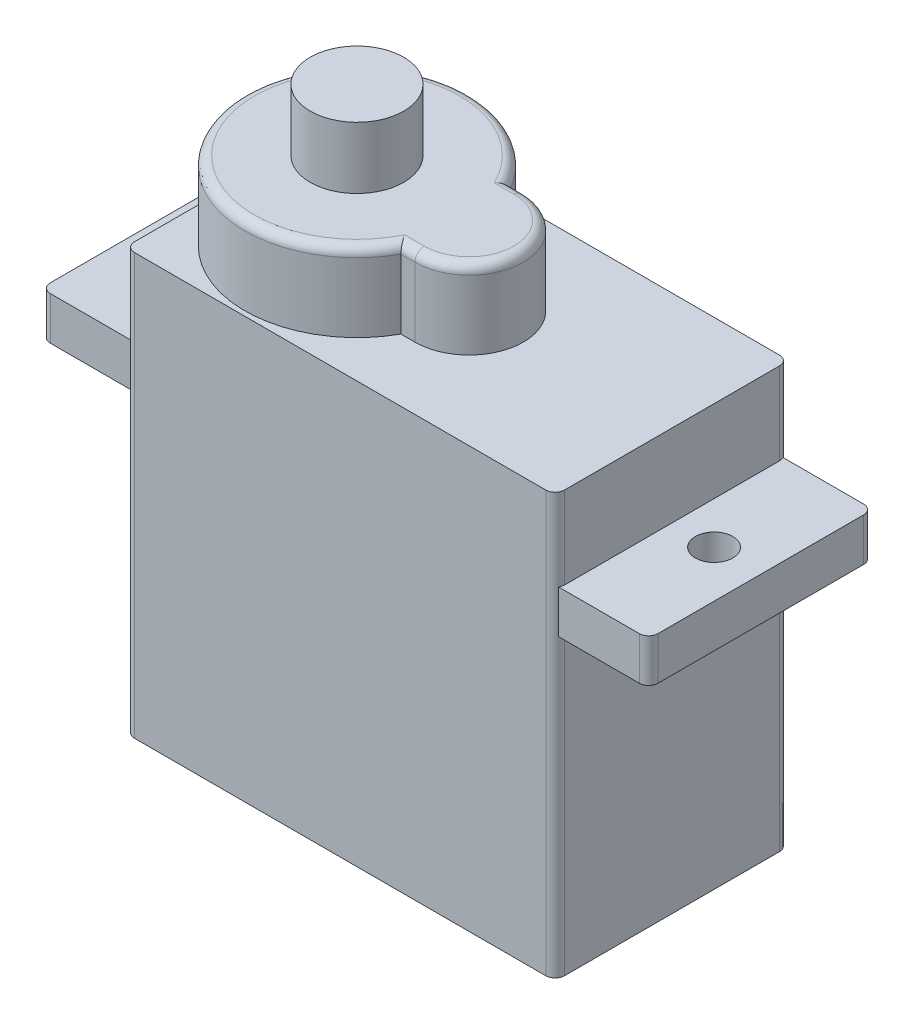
ISO-10303-21;
HEADER;
FILE_DESCRIPTION(('STEP AP214'),'2;1');
FILE_NAME('part.step','',(''),(''),'','','');
FILE_SCHEMA(('AUTOMOTIVE_DESIGN { 1 0 10303 214 1 1 1 1 }'));
ENDSEC;
DATA;
#1=APPLICATION_CONTEXT('core data for automotive mechanical design processes');
#2=APPLICATION_PROTOCOL_DEFINITION('international standard','automotive_design',2000,#1);
#3=PRODUCT_CONTEXT('',#1,'mechanical');
#4=PRODUCT('Part','Part','',(#3));
#5=PRODUCT_RELATED_PRODUCT_CATEGORY('part','',(#4));
#6=PRODUCT_DEFINITION_FORMATION('','',#4);
#7=PRODUCT_DEFINITION_CONTEXT('part definition',#1,'design');
#8=PRODUCT_DEFINITION('design','',#6,#7);
#9=PRODUCT_DEFINITION_SHAPE('','',#8);
#10=(LENGTH_UNIT() NAMED_UNIT(*) SI_UNIT(.MILLI.,.METRE.));
#11=(NAMED_UNIT(*) PLANE_ANGLE_UNIT() SI_UNIT($,.RADIAN.));
#12=(NAMED_UNIT(*) SI_UNIT($,.STERADIAN.) SOLID_ANGLE_UNIT());
#13=UNCERTAINTY_MEASURE_WITH_UNIT(LENGTH_MEASURE(1.E-05),#10,'distance_accuracy_value','');
#14=(GEOMETRIC_REPRESENTATION_CONTEXT(3) GLOBAL_UNCERTAINTY_ASSIGNED_CONTEXT((#13)) GLOBAL_UNIT_ASSIGNED_CONTEXT((#10,
#11,#12)) REPRESENTATION_CONTEXT('',''));
#15=CARTESIAN_POINT('',(0.,0.,0.));
#16=DIRECTION('',(0.,0.,1.));
#17=DIRECTION('',(1.,0.,0.));
#18=AXIS2_PLACEMENT_3D('',#15,#16,#17);
#19=CARTESIAN_POINT('',(-6.15,-22.5,-6.25));
#20=DIRECTION('',(-1.,0.,0.));
#21=DIRECTION('',(0.,0.,1.));
#22=AXIS2_PLACEMENT_3D('',#19,#20,#21);
#23=PLANE('',#22);
#24=DIRECTION('',(0.,0.,1.));
#25=VECTOR('',#24,1.);
#26=CARTESIAN_POINT('',(-6.15,-22.5,-6.25));
#27=LINE('',#26,#25);
#28=CARTESIAN_POINT('',(-6.15,-22.5,-5.75));
#29=VERTEX_POINT('',#28);
#30=CARTESIAN_POINT('',(-6.15,-22.5,5.75));
#31=VERTEX_POINT('',#30);
#32=EDGE_CURVE('E278',#29,#31,#27,.T.);
#33=ORIENTED_EDGE('',*,*,#32,.T.);
#34=DIRECTION('',(0.,1.,0.));
#35=VECTOR('',#34,1.);
#36=CARTESIAN_POINT('',(-6.15,-22.5,5.75));
#37=LINE('',#36,#35);
#38=CARTESIAN_POINT('',(-6.15,-6.7,5.75));
#39=VERTEX_POINT('',#38);
#40=EDGE_CURVE('E395',#31,#39,#37,.T.);
#41=ORIENTED_EDGE('',*,*,#40,.T.);
#42=DIRECTION('',(0.,0.,-1.));
#43=VECTOR('',#42,1.);
#44=CARTESIAN_POINT('',(-6.15,-6.7,-6.25));
#45=LINE('',#44,#43);
#46=CARTESIAN_POINT('',(-6.15,-6.7,-5.75));
#47=VERTEX_POINT('',#46);
#48=EDGE_CURVE('E499',#39,#47,#45,.T.);
#49=ORIENTED_EDGE('',*,*,#48,.T.);
#50=DIRECTION('',(0.,1.,0.));
#51=VECTOR('',#50,1.);
#52=CARTESIAN_POINT('',(-6.15,-22.5,-5.75));
#53=LINE('',#52,#51);
#54=EDGE_CURVE('E389',#47,#29,#53,.F.);
#55=ORIENTED_EDGE('',*,*,#54,.T.);
#56=EDGE_LOOP('',(#33,#41,#49,#55));
#57=FACE_BOUND('',#56,.T.);
#58=ADVANCED_FACE('F37',(#57),#23,.T.);
#59=CARTESIAN_POINT('',(16.85,-22.5,-6.25));
#60=DIRECTION('',(1.,0.,0.));
#61=DIRECTION('',(0.,0.,-1.));
#62=AXIS2_PLACEMENT_3D('',#59,#60,#61);
#63=PLANE('',#62);
#64=DIRECTION('',(0.,0.,-1.));
#65=VECTOR('',#64,1.);
#66=CARTESIAN_POINT('',(16.85,0.,-6.25));
#67=LINE('',#66,#65);
#68=CARTESIAN_POINT('',(16.85,0.,5.75));
#69=VERTEX_POINT('',#68);
#70=CARTESIAN_POINT('',(16.85,0.,-5.75));
#71=VERTEX_POINT('',#70);
#72=EDGE_CURVE('E297',#69,#71,#67,.T.);
#73=ORIENTED_EDGE('',*,*,#72,.F.);
#74=DIRECTION('',(0.,1.,0.));
#75=VECTOR('',#74,1.);
#76=CARTESIAN_POINT('',(16.85,-22.5,5.75));
#77=LINE('',#76,#75);
#78=CARTESIAN_POINT('',(16.85,-4.4,5.75));
#79=VERTEX_POINT('',#78);
#80=EDGE_CURVE('E379',#69,#79,#77,.F.);
#81=ORIENTED_EDGE('',*,*,#80,.T.);
#82=DIRECTION('',(0.,0.,1.));
#83=VECTOR('',#82,1.);
#84=CARTESIAN_POINT('',(16.85,-4.4,-6.25));
#85=LINE('',#84,#83);
#86=CARTESIAN_POINT('',(16.85,-4.4,-5.75));
#87=VERTEX_POINT('',#86);
#88=EDGE_CURVE('E304',#87,#79,#85,.T.);
#89=ORIENTED_EDGE('',*,*,#88,.F.);
#90=DIRECTION('',(0.,1.,0.));
#91=VECTOR('',#90,1.);
#92=CARTESIAN_POINT('',(16.85,-22.5,-5.75));
#93=LINE('',#92,#91);
#94=EDGE_CURVE('E372',#87,#71,#93,.T.);
#95=ORIENTED_EDGE('',*,*,#94,.T.);
#96=EDGE_LOOP('',(#73,#81,#89,#95));
#97=FACE_BOUND('',#96,.T.);
#98=ADVANCED_FACE('F472',(#97),#63,.T.);
#99=DIRECTION('',(0.,0.,-1.));
#100=VECTOR('',#99,1.);
#101=CARTESIAN_POINT('',(-6.15,-4.4,-6.25));
#102=LINE('',#101,#100);
#103=CARTESIAN_POINT('',(-6.15,-4.4,5.75));
#104=VERTEX_POINT('',#103);
#105=CARTESIAN_POINT('',(-6.15,-4.4,-5.75));
#106=VERTEX_POINT('',#105);
#107=EDGE_CURVE('E493',#104,#106,#102,.T.);
#108=ORIENTED_EDGE('',*,*,#107,.F.);
#109=DIRECTION('',(0.,1.,0.));
#110=VECTOR('',#109,1.);
#111=CARTESIAN_POINT('',(-6.15,-22.5,5.75));
#112=LINE('',#111,#110);
#113=CARTESIAN_POINT('',(-6.15,0.,5.75));
#114=VERTEX_POINT('',#113);
#115=EDGE_CURVE('E393',#104,#114,#112,.T.);
#116=ORIENTED_EDGE('',*,*,#115,.T.);
#117=DIRECTION('',(0.,0.,1.));
#118=VECTOR('',#117,1.);
#119=CARTESIAN_POINT('',(-6.15,0.,-6.25));
#120=LINE('',#119,#118);
#121=CARTESIAN_POINT('',(-6.15,0.,-5.75));
#122=VERTEX_POINT('',#121);
#123=EDGE_CURVE('E252',#122,#114,#120,.T.);
#124=ORIENTED_EDGE('',*,*,#123,.F.);
#125=DIRECTION('',(0.,1.,0.));
#126=VECTOR('',#125,1.);
#127=CARTESIAN_POINT('',(-6.15,-22.5,-5.75));
#128=LINE('',#127,#126);
#129=EDGE_CURVE('E391',#122,#106,#128,.F.);
#130=ORIENTED_EDGE('',*,*,#129,.T.);
#131=EDGE_LOOP('',(#108,#116,#124,#130));
#132=FACE_BOUND('',#131,.T.);
#133=ADVANCED_FACE('F475',(#132),#23,.T.);
#134=DIRECTION('',(0.,0.,1.));
#135=VECTOR('',#134,1.);
#136=CARTESIAN_POINT('',(16.85,-6.7,-6.25));
#137=LINE('',#136,#135);
#138=CARTESIAN_POINT('',(16.85,-6.7,-5.75));
#139=VERTEX_POINT('',#138);
#140=CARTESIAN_POINT('',(16.85,-6.7,5.75));
#141=VERTEX_POINT('',#140);
#142=EDGE_CURVE('E291',#139,#141,#137,.T.);
#143=ORIENTED_EDGE('',*,*,#142,.T.);
#144=DIRECTION('',(0.,1.,0.));
#145=VECTOR('',#144,1.);
#146=CARTESIAN_POINT('',(16.85,-22.5,5.75));
#147=LINE('',#146,#145);
#148=CARTESIAN_POINT('',(16.85,-22.5,5.75));
#149=VERTEX_POINT('',#148);
#150=EDGE_CURVE('E377',#141,#149,#147,.F.);
#151=ORIENTED_EDGE('',*,*,#150,.T.);
#152=DIRECTION('',(0.,0.,-1.));
#153=VECTOR('',#152,1.);
#154=CARTESIAN_POINT('',(16.85,-22.5,-6.25));
#155=LINE('',#154,#153);
#156=CARTESIAN_POINT('',(16.85,-22.5,-5.75));
#157=VERTEX_POINT('',#156);
#158=EDGE_CURVE('E285',#149,#157,#155,.T.);
#159=ORIENTED_EDGE('',*,*,#158,.T.);
#160=DIRECTION('',(0.,1.,0.));
#161=VECTOR('',#160,1.);
#162=CARTESIAN_POINT('',(16.85,-22.5,-5.75));
#163=LINE('',#162,#161);
#164=EDGE_CURVE('E374',#157,#139,#163,.T.);
#165=ORIENTED_EDGE('',*,*,#164,.T.);
#166=EDGE_LOOP('',(#143,#151,#159,#165));
#167=FACE_BOUND('',#166,.T.);
#168=ADVANCED_FACE('F481',(#167),#63,.T.);
#169=CARTESIAN_POINT('',(6.,4.2,0.));
#170=DIRECTION('',(0.,1.,0.));
#171=DIRECTION('',(0.,0.,1.));
#172=AXIS2_PLACEMENT_3D('',#169,#170,#171);
#173=PLANE('',#172);
#174=DIRECTION('',(1.,0.,0.));
#175=VECTOR('',#174,1.);
#176=CARTESIAN_POINT('',(6.,4.2,2.4));
#177=LINE('',#176,#175);
#178=CARTESIAN_POINT('',(4.94873721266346,4.2,2.39999999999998));
#179=VERTEX_POINT('',#178);
#180=CARTESIAN_POINT('',(6.,4.2,2.4));
#181=VERTEX_POINT('',#180);
#182=EDGE_CURVE('E346',#179,#181,#177,.T.);
#183=ORIENTED_EDGE('',*,*,#182,.T.);
#184=CARTESIAN_POINT('',(6.,4.2,0.));
#185=DIRECTION('',(0.,1.,0.));
#186=DIRECTION('',(0.,0.,1.));
#187=AXIS2_PLACEMENT_3D('',#184,#185,#186);
#188=CIRCLE('',#187,2.4);
#189=CARTESIAN_POINT('',(6.,4.2,-2.4));
#190=VERTEX_POINT('',#189);
#191=EDGE_CURVE('E349',#181,#190,#188,.T.);
#192=ORIENTED_EDGE('',*,*,#191,.T.);
#193=DIRECTION('',(-1.,0.,0.));
#194=VECTOR('',#193,1.);
#195=CARTESIAN_POINT('',(5.25261839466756,4.2,-2.4));
#196=LINE('',#195,#194);
#197=CARTESIAN_POINT('',(4.94873721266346,4.2,-2.39999999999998));
#198=VERTEX_POINT('',#197);
#199=EDGE_CURVE('E344',#190,#198,#196,.T.);
#200=ORIENTED_EDGE('',*,*,#199,.T.);
#201=CARTESIAN_POINT('',(0.,4.2,0.));
#202=DIRECTION('',(0.,1.,0.));
#203=DIRECTION('',(0.,0.,1.));
#204=AXIS2_PLACEMENT_3D('',#201,#202,#203);
#205=CIRCLE('',#204,5.5);
#206=EDGE_CURVE('E342',#198,#179,#205,.T.);
#207=ORIENTED_EDGE('',*,*,#206,.T.);
#208=EDGE_LOOP('',(#183,#192,#200,#207));
#209=FACE_BOUND('',#208,.T.);
#210=CARTESIAN_POINT('',(0.,4.2,0.));
#211=DIRECTION('',(0.,1.,0.));
#212=DIRECTION('',(0.,0.,1.));
#213=AXIS2_PLACEMENT_3D('',#210,#211,#212);
#214=CIRCLE('',#213,2.5);
#215=CARTESIAN_POINT('',(0.,4.2,2.5));
#216=VERTEX_POINT('',#215);
#217=EDGE_CURVE('E498',#216,#216,#214,.T.);
#218=ORIENTED_EDGE('',*,*,#217,.F.);
#219=EDGE_LOOP('',(#218));
#220=FACE_BOUND('',#219,.T.);
#221=ADVANCED_FACE('F489',(#209,#220),#173,.T.);
#222=CARTESIAN_POINT('',(-6.15,0.,6.25));
#223=DIRECTION('',(0.,1.,0.));
#224=DIRECTION('',(0.,0.,1.));
#225=AXIS2_PLACEMENT_3D('',#222,#223,#224);
#226=PLANE('',#225);
#227=DIRECTION('',(1.,0.,0.));
#228=VECTOR('',#227,1.);
#229=CARTESIAN_POINT('',(-6.15,0.,6.25));
#230=LINE('',#229,#228);
#231=CARTESIAN_POINT('',(-5.65,0.,6.25));
#232=VERTEX_POINT('',#231);
#233=CARTESIAN_POINT('',(16.35,0.,6.25));
#234=VERTEX_POINT('',#233);
#235=EDGE_CURVE('E294',#232,#234,#230,.T.);
#236=ORIENTED_EDGE('',*,*,#235,.T.);
#237=CARTESIAN_POINT('',(16.35,0.,5.75));
#238=DIRECTION('',(0.,1.,0.));
#239=DIRECTION('',(0.,0.,1.));
#240=AXIS2_PLACEMENT_3D('',#237,#238,#239);
#241=CIRCLE('',#240,0.5);
#242=EDGE_CURVE('E370',#234,#69,#241,.T.);
#243=ORIENTED_EDGE('',*,*,#242,.T.);
#244=ORIENTED_EDGE('',*,*,#72,.T.);
#245=CARTESIAN_POINT('',(16.35,0.,-5.75));
#246=DIRECTION('',(0.,1.,0.));
#247=DIRECTION('',(0.,0.,1.));
#248=AXIS2_PLACEMENT_3D('',#245,#246,#247);
#249=CIRCLE('',#248,0.5);
#250=CARTESIAN_POINT('',(16.35,0.,-6.25));
#251=VERTEX_POINT('',#250);
#252=EDGE_CURVE('E364',#71,#251,#249,.T.);
#253=ORIENTED_EDGE('',*,*,#252,.T.);
#254=DIRECTION('',(-1.,0.,0.));
#255=VECTOR('',#254,1.);
#256=CARTESIAN_POINT('',(-6.15,0.,-6.25));
#257=LINE('',#256,#255);
#258=CARTESIAN_POINT('',(-5.65,0.,-6.25));
#259=VERTEX_POINT('',#258);
#260=EDGE_CURVE('E282',#251,#259,#257,.T.);
#261=ORIENTED_EDGE('',*,*,#260,.T.);
#262=CARTESIAN_POINT('',(-5.65,0.,-5.75));
#263=DIRECTION('',(0.,1.,0.));
#264=DIRECTION('',(0.,0.,1.));
#265=AXIS2_PLACEMENT_3D('',#262,#263,#264);
#266=CIRCLE('',#265,0.5);
#267=EDGE_CURVE('E366',#259,#122,#266,.T.);
#268=ORIENTED_EDGE('',*,*,#267,.T.);
#269=ORIENTED_EDGE('',*,*,#123,.T.);
#270=CARTESIAN_POINT('',(-5.65,0.,5.75));
#271=DIRECTION('',(0.,1.,0.));
#272=DIRECTION('',(0.,0.,1.));
#273=AXIS2_PLACEMENT_3D('',#270,#271,#272);
#274=CIRCLE('',#273,0.5);
#275=EDGE_CURVE('E368',#114,#232,#274,.T.);
#276=ORIENTED_EDGE('',*,*,#275,.T.);
#277=EDGE_LOOP('',(#236,#243,#244,#253,#261,#268,#269,#276));
#278=FACE_BOUND('',#277,.T.);
#279=DIRECTION('',(-1.,0.,0.));
#280=VECTOR('',#279,1.);
#281=CARTESIAN_POINT('',(6.,0.,-2.9));
#282=LINE('',#281,#280);
#283=CARTESIAN_POINT('',(6.,0.,-2.9));
#284=VERTEX_POINT('',#283);
#285=CARTESIAN_POINT('',(5.25261839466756,0.,-2.9));
#286=VERTEX_POINT('',#285);
#287=EDGE_CURVE('E246',#284,#286,#282,.T.);
#288=ORIENTED_EDGE('',*,*,#287,.F.);
#289=CARTESIAN_POINT('',(6.,0.,0.));
#290=DIRECTION('',(0.,1.,0.));
#291=DIRECTION('',(0.,0.,1.));
#292=AXIS2_PLACEMENT_3D('',#289,#290,#291);
#293=CIRCLE('',#292,2.9);
#294=CARTESIAN_POINT('',(6.,0.,2.9));
#295=VERTEX_POINT('',#294);
#296=EDGE_CURVE('E256',#295,#284,#293,.T.);
#297=ORIENTED_EDGE('',*,*,#296,.F.);
#298=DIRECTION('',(1.,0.,0.));
#299=VECTOR('',#298,1.);
#300=CARTESIAN_POINT('',(6.,0.,2.9));
#301=LINE('',#300,#299);
#302=CARTESIAN_POINT('',(5.25261839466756,0.,2.9));
#303=VERTEX_POINT('',#302);
#304=EDGE_CURVE('E269',#303,#295,#301,.T.);
#305=ORIENTED_EDGE('',*,*,#304,.F.);
#306=CARTESIAN_POINT('',(0.,0.,0.));
#307=DIRECTION('',(0.,1.,0.));
#308=DIRECTION('',(0.,0.,1.));
#309=AXIS2_PLACEMENT_3D('',#306,#307,#308);
#310=CIRCLE('',#309,6.);
#311=EDGE_CURVE('E267',#286,#303,#310,.T.);
#312=ORIENTED_EDGE('',*,*,#311,.F.);
#313=EDGE_LOOP('',(#288,#297,#305,#312));
#314=FACE_BOUND('',#313,.T.);
#315=ADVANCED_FACE('F265',(#278,#314),#226,.T.);
#316=CARTESIAN_POINT('',(-6.15,-22.5,-6.25));
#317=DIRECTION('',(0.,0.,-1.));
#318=DIRECTION('',(-1.,0.,0.));
#319=AXIS2_PLACEMENT_3D('',#316,#317,#318);
#320=PLANE('',#319);
#321=DIRECTION('',(-1.,0.,0.));
#322=VECTOR('',#321,1.);
#323=CARTESIAN_POINT('',(-6.15,-22.5,-6.25));
#324=LINE('',#323,#322);
#325=CARTESIAN_POINT('',(16.35,-22.5,-6.25));
#326=VERTEX_POINT('',#325);
#327=CARTESIAN_POINT('',(-5.65,-22.5,-6.25));
#328=VERTEX_POINT('',#327);
#329=EDGE_CURVE('E288',#326,#328,#324,.T.);
#330=ORIENTED_EDGE('',*,*,#329,.T.);
#331=DIRECTION('',(0.,1.,0.));
#332=VECTOR('',#331,1.);
#333=CARTESIAN_POINT('',(-5.65,-22.5,-6.25));
#334=LINE('',#333,#332);
#335=EDGE_CURVE('E400',#328,#259,#334,.T.);
#336=ORIENTED_EDGE('',*,*,#335,.T.);
#337=ORIENTED_EDGE('',*,*,#260,.F.);
#338=DIRECTION('',(0.,1.,0.));
#339=VECTOR('',#338,1.);
#340=CARTESIAN_POINT('',(16.35,-22.5,-6.25));
#341=LINE('',#340,#339);
#342=EDGE_CURVE('E398',#251,#326,#341,.F.);
#343=ORIENTED_EDGE('',*,*,#342,.T.);
#344=EDGE_LOOP('',(#330,#336,#337,#343));
#345=FACE_BOUND('',#344,.T.);
#346=ADVANCED_FACE('F526',(#345),#320,.T.);
#347=CARTESIAN_POINT('',(-6.15,-22.5,6.25));
#348=DIRECTION('',(0.,0.,1.));
#349=DIRECTION('',(1.,0.,0.));
#350=AXIS2_PLACEMENT_3D('',#347,#348,#349);
#351=PLANE('',#350);
#352=DIRECTION('',(1.,0.,0.));
#353=VECTOR('',#352,1.);
#354=CARTESIAN_POINT('',(-6.15,-22.5,6.25));
#355=LINE('',#354,#353);
#356=CARTESIAN_POINT('',(-5.65,-22.5,6.25));
#357=VERTEX_POINT('',#356);
#358=CARTESIAN_POINT('',(16.35,-22.5,6.25));
#359=VERTEX_POINT('',#358);
#360=EDGE_CURVE('E281',#357,#359,#355,.T.);
#361=ORIENTED_EDGE('',*,*,#360,.T.);
#362=DIRECTION('',(0.,1.,0.));
#363=VECTOR('',#362,1.);
#364=CARTESIAN_POINT('',(16.35,-22.5,6.25));
#365=LINE('',#364,#363);
#366=EDGE_CURVE('E361',#359,#234,#365,.T.);
#367=ORIENTED_EDGE('',*,*,#366,.T.);
#368=ORIENTED_EDGE('',*,*,#235,.F.);
#369=DIRECTION('',(0.,1.,0.));
#370=VECTOR('',#369,1.);
#371=CARTESIAN_POINT('',(-5.65,-22.5,6.25));
#372=LINE('',#371,#370);
#373=EDGE_CURVE('E359',#232,#357,#372,.F.);
#374=ORIENTED_EDGE('',*,*,#373,.T.);
#375=EDGE_LOOP('',(#361,#367,#368,#374));
#376=FACE_BOUND('',#375,.T.);
#377=ADVANCED_FACE('F509',(#376),#351,.T.);
#378=CARTESIAN_POINT('',(-6.15,-22.5,6.25));
#379=DIRECTION('',(0.,1.,0.));
#380=DIRECTION('',(0.,0.,1.));
#381=AXIS2_PLACEMENT_3D('',#378,#379,#380);
#382=PLANE('',#381);
#383=ORIENTED_EDGE('',*,*,#158,.F.);
#384=CARTESIAN_POINT('',(16.35,-22.5,5.75));
#385=DIRECTION('',(0.,1.,0.));
#386=DIRECTION('',(0.,0.,1.));
#387=AXIS2_PLACEMENT_3D('',#384,#385,#386);
#388=CIRCLE('',#387,0.5);
#389=EDGE_CURVE('E387',#149,#359,#388,.F.);
#390=ORIENTED_EDGE('',*,*,#389,.T.);
#391=ORIENTED_EDGE('',*,*,#360,.F.);
#392=CARTESIAN_POINT('',(-5.65,-22.5,5.75));
#393=DIRECTION('',(0.,1.,0.));
#394=DIRECTION('',(0.,0.,1.));
#395=AXIS2_PLACEMENT_3D('',#392,#393,#394);
#396=CIRCLE('',#395,0.5);
#397=EDGE_CURVE('E385',#357,#31,#396,.F.);
#398=ORIENTED_EDGE('',*,*,#397,.T.);
#399=ORIENTED_EDGE('',*,*,#32,.F.);
#400=CARTESIAN_POINT('',(-5.65,-22.5,-5.75));
#401=DIRECTION('',(0.,1.,0.));
#402=DIRECTION('',(0.,0.,1.));
#403=AXIS2_PLACEMENT_3D('',#400,#401,#402);
#404=CIRCLE('',#403,0.5);
#405=EDGE_CURVE('E383',#29,#328,#404,.F.);
#406=ORIENTED_EDGE('',*,*,#405,.T.);
#407=ORIENTED_EDGE('',*,*,#329,.F.);
#408=CARTESIAN_POINT('',(16.35,-22.5,-5.75));
#409=DIRECTION('',(0.,1.,0.));
#410=DIRECTION('',(0.,0.,1.));
#411=AXIS2_PLACEMENT_3D('',#408,#409,#410);
#412=CIRCLE('',#411,0.5);
#413=EDGE_CURVE('E381',#326,#157,#412,.F.);
#414=ORIENTED_EDGE('',*,*,#413,.T.);
#415=EDGE_LOOP('',(#383,#390,#391,#398,#399,#406,#407,#414));
#416=FACE_BOUND('',#415,.T.);
#417=ADVANCED_FACE('F603',(#416),#382,.F.);
#418=CARTESIAN_POINT('',(6.,4.2,0.));
#419=DIRECTION('',(0.,-1.,0.));
#420=DIRECTION('',(0.,0.,-1.));
#421=AXIS2_PLACEMENT_3D('',#418,#419,#420);
#422=CYLINDRICAL_SURFACE('',#421,2.9);
#423=DIRECTION('',(0.,-1.,0.));
#424=VECTOR('',#423,1.);
#425=CARTESIAN_POINT('',(6.,4.2,-2.9));
#426=LINE('',#425,#424);
#427=CARTESIAN_POINT('',(6.,3.7,-2.9));
#428=VERTEX_POINT('',#427);
#429=EDGE_CURVE('E241',#428,#284,#426,.T.);
#430=ORIENTED_EDGE('',*,*,#429,.F.);
#431=CARTESIAN_POINT('',(6.,3.7,0.));
#432=DIRECTION('',(0.,1.,0.));
#433=DIRECTION('',(0.,0.,1.));
#434=AXIS2_PLACEMENT_3D('',#431,#432,#433);
#435=CIRCLE('',#434,2.9);
#436=CARTESIAN_POINT('',(6.,3.7,2.9));
#437=VERTEX_POINT('',#436);
#438=EDGE_CURVE('E355',#428,#437,#435,.F.);
#439=ORIENTED_EDGE('',*,*,#438,.T.);
#440=DIRECTION('',(0.,-1.,0.));
#441=VECTOR('',#440,1.);
#442=CARTESIAN_POINT('',(6.,4.2,2.9));
#443=LINE('',#442,#441);
#444=EDGE_CURVE('E259',#437,#295,#443,.T.);
#445=ORIENTED_EDGE('',*,*,#444,.T.);
#446=ORIENTED_EDGE('',*,*,#296,.T.);
#447=EDGE_LOOP('',(#430,#439,#445,#446));
#448=FACE_BOUND('',#447,.T.);
#449=ADVANCED_FACE('F257',(#448),#422,.T.);
#450=CARTESIAN_POINT('',(6.,4.2,-2.9));
#451=DIRECTION('',(0.,0.,1.));
#452=DIRECTION('',(1.,0.,0.));
#453=AXIS2_PLACEMENT_3D('',#450,#451,#452);
#454=PLANE('',#453);
#455=DIRECTION('',(0.,-1.,0.));
#456=VECTOR('',#455,1.);
#457=CARTESIAN_POINT('',(5.25261839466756,4.2,-2.9));
#458=LINE('',#457,#456);
#459=CARTESIAN_POINT('',(5.25261839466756,3.7,-2.9));
#460=VERTEX_POINT('',#459);
#461=EDGE_CURVE('E253',#460,#286,#458,.T.);
#462=ORIENTED_EDGE('',*,*,#461,.F.);
#463=DIRECTION('',(-1.,0.,0.));
#464=VECTOR('',#463,1.);
#465=CARTESIAN_POINT('',(6.,3.7,-2.9));
#466=LINE('',#465,#464);
#467=EDGE_CURVE('E249',#460,#428,#466,.F.);
#468=ORIENTED_EDGE('',*,*,#467,.T.);
#469=ORIENTED_EDGE('',*,*,#429,.T.);
#470=ORIENTED_EDGE('',*,*,#287,.T.);
#471=EDGE_LOOP('',(#462,#468,#469,#470));
#472=FACE_BOUND('',#471,.T.);
#473=ADVANCED_FACE('F244',(#472),#454,.F.);
#474=CARTESIAN_POINT('',(0.,4.2,0.));
#475=DIRECTION('',(0.,-1.,0.));
#476=DIRECTION('',(0.,0.,-1.));
#477=AXIS2_PLACEMENT_3D('',#474,#475,#476);
#478=CYLINDRICAL_SURFACE('',#477,6.);
#479=DIRECTION('',(0.,-1.,0.));
#480=VECTOR('',#479,1.);
#481=CARTESIAN_POINT('',(5.25261839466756,4.2,2.9));
#482=LINE('',#481,#480);
#483=CARTESIAN_POINT('',(5.25261839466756,3.7,2.9));
#484=VERTEX_POINT('',#483);
#485=EDGE_CURVE('E275',#484,#303,#482,.T.);
#486=ORIENTED_EDGE('',*,*,#485,.F.);
#487=CARTESIAN_POINT('',(0.,3.7,0.));
#488=DIRECTION('',(0.,1.,0.));
#489=DIRECTION('',(0.,0.,1.));
#490=AXIS2_PLACEMENT_3D('',#487,#488,#489);
#491=CIRCLE('',#490,6.);
#492=EDGE_CURVE('E357',#484,#460,#491,.F.);
#493=ORIENTED_EDGE('',*,*,#492,.T.);
#494=ORIENTED_EDGE('',*,*,#461,.T.);
#495=ORIENTED_EDGE('',*,*,#311,.T.);
#496=EDGE_LOOP('',(#486,#493,#494,#495));
#497=FACE_BOUND('',#496,.T.);
#498=ADVANCED_FACE('F586',(#497),#478,.T.);
#499=CARTESIAN_POINT('',(6.,4.2,2.9));
#500=DIRECTION('',(0.,0.,-1.));
#501=DIRECTION('',(-1.,0.,0.));
#502=AXIS2_PLACEMENT_3D('',#499,#500,#501);
#503=PLANE('',#502);
#504=ORIENTED_EDGE('',*,*,#444,.F.);
#505=DIRECTION('',(1.,0.,0.));
#506=VECTOR('',#505,1.);
#507=CARTESIAN_POINT('',(5.25261839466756,3.7,2.9));
#508=LINE('',#507,#506);
#509=EDGE_CURVE('E351',#437,#484,#508,.F.);
#510=ORIENTED_EDGE('',*,*,#509,.T.);
#511=ORIENTED_EDGE('',*,*,#485,.T.);
#512=ORIENTED_EDGE('',*,*,#304,.T.);
#513=EDGE_LOOP('',(#504,#510,#511,#512));
#514=FACE_BOUND('',#513,.T.);
#515=ADVANCED_FACE('F577',(#514),#503,.F.);
#516=CARTESIAN_POINT('',(0.,44.5710678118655,0.));
#517=DIRECTION('',(0.,-1.,0.));
#518=DIRECTION('',(0.,0.,-1.));
#519=AXIS2_PLACEMENT_3D('',#516,#517,#518);
#520=CYLINDRICAL_SURFACE('',#519,2.5);
#521=ORIENTED_EDGE('',*,*,#217,.T.);
#522=EDGE_LOOP('',(#521));
#523=FACE_BOUND('',#522,.T.);
#524=CARTESIAN_POINT('',(0.,7.5,0.));
#525=DIRECTION('',(0.,1.,0.));
#526=DIRECTION('',(0.,0.,1.));
#527=AXIS2_PLACEMENT_3D('',#524,#525,#526);
#528=CIRCLE('',#527,2.5);
#529=CARTESIAN_POINT('',(0.,7.5,2.5));
#530=VERTEX_POINT('',#529);
#531=EDGE_CURVE('E263',#530,#530,#528,.T.);
#532=ORIENTED_EDGE('',*,*,#531,.F.);
#533=EDGE_LOOP('',(#532));
#534=FACE_BOUND('',#533,.T.);
#535=ADVANCED_FACE('F575',(#523,#534),#520,.T.);
#536=CARTESIAN_POINT('',(-6.15,7.5,6.25));
#537=DIRECTION('',(0.,1.,0.));
#538=DIRECTION('',(0.,0.,1.));
#539=AXIS2_PLACEMENT_3D('',#536,#537,#538);
#540=PLANE('',#539);
#541=ORIENTED_EDGE('',*,*,#531,.T.);
#542=EDGE_LOOP('',(#541));
#543=FACE_BOUND('',#542,.T.);
#544=ADVANCED_FACE('F573',(#543),#540,.T.);
#545=CARTESIAN_POINT('',(19.1,-4.4,0.));
#546=DIRECTION('',(0.,-1.,0.));
#547=DIRECTION('',(0.,0.,-1.));
#548=AXIS2_PLACEMENT_3D('',#545,#546,#547);
#549=CYLINDRICAL_SURFACE('',#548,0.999999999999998);
#550=CARTESIAN_POINT('',(19.1,-4.4,0.));
#551=DIRECTION('',(0.,1.,0.));
#552=DIRECTION('',(0.,0.,1.));
#553=AXIS2_PLACEMENT_3D('',#550,#551,#552);
#554=CIRCLE('',#553,0.999999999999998);
#555=CARTESIAN_POINT('',(19.1,-4.4,0.999999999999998));
#556=VERTEX_POINT('',#555);
#557=EDGE_CURVE('E788',#556,#556,#554,.T.);
#558=ORIENTED_EDGE('',*,*,#557,.T.);
#559=EDGE_LOOP('',(#558));
#560=FACE_BOUND('',#559,.T.);
#561=CARTESIAN_POINT('',(19.1,-6.7,0.));
#562=DIRECTION('',(0.,1.,0.));
#563=DIRECTION('',(0.,0.,1.));
#564=AXIS2_PLACEMENT_3D('',#561,#562,#563);
#565=CIRCLE('',#564,0.999999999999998);
#566=CARTESIAN_POINT('',(19.1,-6.7,0.999999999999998));
#567=VERTEX_POINT('',#566);
#568=EDGE_CURVE('E785',#567,#567,#565,.T.);
#569=ORIENTED_EDGE('',*,*,#568,.F.);
#570=EDGE_LOOP('',(#569));
#571=FACE_BOUND('',#570,.T.);
#572=ADVANCED_FACE('F584',(#560,#571),#549,.F.);
#573=CARTESIAN_POINT('',(21.6,-4.4,6.));
#574=DIRECTION('',(-1.,0.,0.));
#575=DIRECTION('',(0.,0.,1.));
#576=AXIS2_PLACEMENT_3D('',#573,#574,#575);
#577=PLANE('',#576);
#578=DIRECTION('',(0.,0.,-1.));
#579=VECTOR('',#578,1.);
#580=CARTESIAN_POINT('',(21.6,-4.4,6.));
#581=LINE('',#580,#579);
#582=CARTESIAN_POINT('',(21.6,-4.4,5.5));
#583=VERTEX_POINT('',#582);
#584=CARTESIAN_POINT('',(21.6,-4.4,-5.5));
#585=VERTEX_POINT('',#584);
#586=EDGE_CURVE('E540',#583,#585,#581,.T.);
#587=ORIENTED_EDGE('',*,*,#586,.F.);
#588=DIRECTION('',(0.,-1.,0.));
#589=VECTOR('',#588,1.);
#590=CARTESIAN_POINT('',(21.6,-4.4,5.5));
#591=LINE('',#590,#589);
#592=CARTESIAN_POINT('',(21.6,-6.7,5.5));
#593=VERTEX_POINT('',#592);
#594=EDGE_CURVE('E309',#583,#593,#591,.T.);
#595=ORIENTED_EDGE('',*,*,#594,.T.);
#596=DIRECTION('',(0.,0.,-1.));
#597=VECTOR('',#596,1.);
#598=CARTESIAN_POINT('',(21.6,-6.7,6.));
#599=LINE('',#598,#597);
#600=CARTESIAN_POINT('',(21.6,-6.7,-5.5));
#601=VERTEX_POINT('',#600);
#602=EDGE_CURVE('E791',#593,#601,#599,.T.);
#603=ORIENTED_EDGE('',*,*,#602,.T.);
#604=DIRECTION('',(0.,-1.,0.));
#605=VECTOR('',#604,1.);
#606=CARTESIAN_POINT('',(21.6,-4.4,-5.5));
#607=LINE('',#606,#605);
#608=EDGE_CURVE('E307',#601,#585,#607,.F.);
#609=ORIENTED_EDGE('',*,*,#608,.T.);
#610=EDGE_LOOP('',(#587,#595,#603,#609));
#611=FACE_BOUND('',#610,.T.);
#612=ADVANCED_FACE('F590',(#611),#577,.F.);
#613=CARTESIAN_POINT('',(21.6,-4.4,6.));
#614=DIRECTION('',(0.,0.,-1.));
#615=DIRECTION('',(-1.,0.,0.));
#616=AXIS2_PLACEMENT_3D('',#613,#614,#615);
#617=PLANE('',#616);
#618=DIRECTION('',(1.,0.,0.));
#619=VECTOR('',#618,1.);
#620=CARTESIAN_POINT('',(21.6,-6.7,6.));
#621=LINE('',#620,#619);
#622=CARTESIAN_POINT('',(16.7830127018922,-6.7,6.));
#623=VERTEX_POINT('',#622);
#624=CARTESIAN_POINT('',(21.1,-6.7,6.));
#625=VERTEX_POINT('',#624);
#626=EDGE_CURVE('E557',#623,#625,#621,.T.);
#627=ORIENTED_EDGE('',*,*,#626,.T.);
#628=DIRECTION('',(0.,-1.,0.));
#629=VECTOR('',#628,1.);
#630=CARTESIAN_POINT('',(21.1,-4.4,6.));
#631=LINE('',#630,#629);
#632=CARTESIAN_POINT('',(21.1,-4.4,6.));
#633=VERTEX_POINT('',#632);
#634=EDGE_CURVE('E316',#625,#633,#631,.F.);
#635=ORIENTED_EDGE('',*,*,#634,.T.);
#636=DIRECTION('',(1.,0.,0.));
#637=VECTOR('',#636,1.);
#638=CARTESIAN_POINT('',(21.6,-4.4,6.));
#639=LINE('',#638,#637);
#640=CARTESIAN_POINT('',(16.7830127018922,-4.4,6.));
#641=VERTEX_POINT('',#640);
#642=EDGE_CURVE('E797',#641,#633,#639,.T.);
#643=ORIENTED_EDGE('',*,*,#642,.F.);
#644=DIRECTION('',(0.,1.,0.));
#645=VECTOR('',#644,1.);
#646=CARTESIAN_POINT('',(16.7830127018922,-4.4,6.));
#647=LINE('',#646,#645);
#648=EDGE_CURVE('E406',#641,#623,#647,.F.);
#649=ORIENTED_EDGE('',*,*,#648,.T.);
#650=EDGE_LOOP('',(#627,#635,#643,#649));
#651=FACE_BOUND('',#650,.T.);
#652=ADVANCED_FACE('F641',(#651),#617,.F.);
#653=CARTESIAN_POINT('',(21.6,-4.4,-6.));
#654=DIRECTION('',(0.,0.,1.));
#655=DIRECTION('',(1.,0.,0.));
#656=AXIS2_PLACEMENT_3D('',#653,#654,#655);
#657=PLANE('',#656);
#658=DIRECTION('',(-1.,0.,0.));
#659=VECTOR('',#658,1.);
#660=CARTESIAN_POINT('',(21.6,-4.4,-6.));
#661=LINE('',#660,#659);
#662=CARTESIAN_POINT('',(21.1,-4.4,-6.));
#663=VERTEX_POINT('',#662);
#664=CARTESIAN_POINT('',(16.7830127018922,-4.4,-6.));
#665=VERTEX_POINT('',#664);
#666=EDGE_CURVE('E58',#663,#665,#661,.T.);
#667=ORIENTED_EDGE('',*,*,#666,.F.);
#668=DIRECTION('',(0.,-1.,0.));
#669=VECTOR('',#668,1.);
#670=CARTESIAN_POINT('',(21.1,-4.4,-6.));
#671=LINE('',#670,#669);
#672=CARTESIAN_POINT('',(21.1,-6.7,-6.));
#673=VERTEX_POINT('',#672);
#674=EDGE_CURVE('E322',#663,#673,#671,.T.);
#675=ORIENTED_EDGE('',*,*,#674,.T.);
#676=DIRECTION('',(-1.,0.,0.));
#677=VECTOR('',#676,1.);
#678=CARTESIAN_POINT('',(21.6,-6.7,-6.));
#679=LINE('',#678,#677);
#680=CARTESIAN_POINT('',(16.7830127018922,-6.7,-6.));
#681=VERTEX_POINT('',#680);
#682=EDGE_CURVE('E65',#673,#681,#679,.T.);
#683=ORIENTED_EDGE('',*,*,#682,.T.);
#684=DIRECTION('',(0.,1.,0.));
#685=VECTOR('',#684,1.);
#686=CARTESIAN_POINT('',(16.7830127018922,-6.7,-6.));
#687=LINE('',#686,#685);
#688=EDGE_CURVE('E51',#681,#665,#687,.T.);
#689=ORIENTED_EDGE('',*,*,#688,.T.);
#690=EDGE_LOOP('',(#667,#675,#683,#689));
#691=FACE_BOUND('',#690,.T.);
#692=ADVANCED_FACE('F646',(#691),#657,.F.);
#693=CARTESIAN_POINT('',(21.6,-6.7,-6.));
#694=DIRECTION('',(0.,1.,0.));
#695=DIRECTION('',(0.,0.,1.));
#696=AXIS2_PLACEMENT_3D('',#693,#694,#695);
#697=PLANE('',#696);
#698=ORIENTED_EDGE('',*,*,#602,.F.);
#699=CARTESIAN_POINT('',(21.1,-6.7,5.5));
#700=DIRECTION('',(0.,1.,0.));
#701=DIRECTION('',(0.,0.,1.));
#702=AXIS2_PLACEMENT_3D('',#699,#700,#701);
#703=CIRCLE('',#702,0.5);
#704=EDGE_CURVE('E314',#593,#625,#703,.F.);
#705=ORIENTED_EDGE('',*,*,#704,.T.);
#706=ORIENTED_EDGE('',*,*,#626,.F.);
#707=CARTESIAN_POINT('',(16.35,-6.7,5.75));
#708=DIRECTION('',(0.,1.,0.));
#709=DIRECTION('',(0.,0.,1.));
#710=AXIS2_PLACEMENT_3D('',#707,#708,#709);
#711=CIRCLE('',#710,0.5);
#712=EDGE_CURVE('E409',#623,#141,#711,.T.);
#713=ORIENTED_EDGE('',*,*,#712,.T.);
#714=ORIENTED_EDGE('',*,*,#142,.F.);
#715=CARTESIAN_POINT('',(16.35,-6.7,-5.75));
#716=DIRECTION('',(0.,1.,0.));
#717=DIRECTION('',(0.,0.,1.));
#718=AXIS2_PLACEMENT_3D('',#715,#716,#717);
#719=CIRCLE('',#718,0.5);
#720=EDGE_CURVE('E427',#139,#681,#719,.T.);
#721=ORIENTED_EDGE('',*,*,#720,.T.);
#722=ORIENTED_EDGE('',*,*,#682,.F.);
#723=CARTESIAN_POINT('',(21.1,-6.7,-5.5));
#724=DIRECTION('',(0.,1.,0.));
#725=DIRECTION('',(0.,0.,1.));
#726=AXIS2_PLACEMENT_3D('',#723,#724,#725);
#727=CIRCLE('',#726,0.5);
#728=EDGE_CURVE('E312',#673,#601,#727,.F.);
#729=ORIENTED_EDGE('',*,*,#728,.T.);
#730=EDGE_LOOP('',(#698,#705,#706,#713,#714,#721,#722,#729));
#731=FACE_BOUND('',#730,.T.);
#732=ORIENTED_EDGE('',*,*,#568,.T.);
#733=EDGE_LOOP('',(#732));
#734=FACE_BOUND('',#733,.T.);
#735=ADVANCED_FACE('F659',(#731,#734),#697,.F.);
#736=CARTESIAN_POINT('',(21.6,-4.4,-6.));
#737=DIRECTION('',(0.,1.,0.));
#738=DIRECTION('',(0.,0.,1.));
#739=AXIS2_PLACEMENT_3D('',#736,#737,#738);
#740=PLANE('',#739);
#741=ORIENTED_EDGE('',*,*,#557,.F.);
#742=EDGE_LOOP('',(#741));
#743=FACE_BOUND('',#742,.T.);
#744=ORIENTED_EDGE('',*,*,#642,.T.);
#745=CARTESIAN_POINT('',(21.1,-4.4,5.5));
#746=DIRECTION('',(0.,1.,0.));
#747=DIRECTION('',(0.,0.,1.));
#748=AXIS2_PLACEMENT_3D('',#745,#746,#747);
#749=CIRCLE('',#748,0.5);
#750=EDGE_CURVE('E320',#633,#583,#749,.T.);
#751=ORIENTED_EDGE('',*,*,#750,.T.);
#752=ORIENTED_EDGE('',*,*,#586,.T.);
#753=CARTESIAN_POINT('',(21.1,-4.4,-5.5));
#754=DIRECTION('',(0.,1.,0.));
#755=DIRECTION('',(0.,0.,1.));
#756=AXIS2_PLACEMENT_3D('',#753,#754,#755);
#757=CIRCLE('',#756,0.5);
#758=EDGE_CURVE('E318',#585,#663,#757,.T.);
#759=ORIENTED_EDGE('',*,*,#758,.T.);
#760=ORIENTED_EDGE('',*,*,#666,.T.);
#761=CARTESIAN_POINT('',(16.35,-4.4,-5.75));
#762=DIRECTION('',(0.,1.,0.));
#763=DIRECTION('',(0.,0.,1.));
#764=AXIS2_PLACEMENT_3D('',#761,#762,#763);
#765=CIRCLE('',#764,0.5);
#766=EDGE_CURVE('E12',#665,#87,#765,.F.);
#767=ORIENTED_EDGE('',*,*,#766,.T.);
#768=ORIENTED_EDGE('',*,*,#88,.T.);
#769=CARTESIAN_POINT('',(16.35,-4.4,5.75));
#770=DIRECTION('',(0.,1.,0.));
#771=DIRECTION('',(0.,0.,1.));
#772=AXIS2_PLACEMENT_3D('',#769,#770,#771);
#773=CIRCLE('',#772,0.5);
#774=EDGE_CURVE('E403',#79,#641,#773,.F.);
#775=ORIENTED_EDGE('',*,*,#774,.T.);
#776=EDGE_LOOP('',(#744,#751,#752,#759,#760,#767,#768,#775));
#777=FACE_BOUND('',#776,.T.);
#778=ADVANCED_FACE('F668',(#743,#777),#740,.T.);
#779=CARTESIAN_POINT('',(-8.4,-4.4,0.));
#780=DIRECTION('',(0.,1.,0.));
#781=DIRECTION('',(0.,0.,-1.));
#782=AXIS2_PLACEMENT_3D('',#779,#780,#781);
#783=CIRCLE('',#782,0.999999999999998);
#784=CARTESIAN_POINT('',(-8.4,-4.4,-0.999999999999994));
#785=VERTEX_POINT('',#784);
#786=EDGE_CURVE('E781',#785,#785,#783,.T.);
#787=ORIENTED_EDGE('',*,*,#786,.F.);
#788=EDGE_LOOP('',(#787));
#789=FACE_BOUND('',#788,.T.);
#790=DIRECTION('',(0.,0.,1.));
#791=VECTOR('',#790,1.);
#792=CARTESIAN_POINT('',(-10.9,-4.4,6.));
#793=LINE('',#792,#791);
#794=CARTESIAN_POINT('',(-10.9,-4.4,-5.5));
#795=VERTEX_POINT('',#794);
#796=CARTESIAN_POINT('',(-10.9,-4.4,5.5));
#797=VERTEX_POINT('',#796);
#798=EDGE_CURVE('E551',#795,#797,#793,.T.);
#799=ORIENTED_EDGE('',*,*,#798,.T.);
#800=CARTESIAN_POINT('',(-10.4,-4.4,5.5));
#801=DIRECTION('',(0.,1.,0.));
#802=DIRECTION('',(0.,0.,1.));
#803=AXIS2_PLACEMENT_3D('',#800,#801,#802);
#804=CIRCLE('',#803,0.5);
#805=CARTESIAN_POINT('',(-10.4,-4.4,6.));
#806=VERTEX_POINT('',#805);
#807=EDGE_CURVE('E338',#797,#806,#804,.T.);
#808=ORIENTED_EDGE('',*,*,#807,.T.);
#809=CARTESIAN_POINT('',(-6.08301270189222,-4.4,6.));
#810=VERTEX_POINT('',#809);
#811=EDGE_CURVE('E567',#806,#810,#639,.T.);
#812=ORIENTED_EDGE('',*,*,#811,.T.);
#813=CARTESIAN_POINT('',(-5.65,-4.4,5.75));
#814=DIRECTION('',(0.,1.,0.));
#815=DIRECTION('',(0.,0.,1.));
#816=AXIS2_PLACEMENT_3D('',#813,#814,#815);
#817=CIRCLE('',#816,0.5);
#818=EDGE_CURVE('E417',#810,#104,#817,.F.);
#819=ORIENTED_EDGE('',*,*,#818,.T.);
#820=ORIENTED_EDGE('',*,*,#107,.T.);
#821=CARTESIAN_POINT('',(-5.65,-4.4,-5.75));
#822=DIRECTION('',(0.,1.,0.));
#823=DIRECTION('',(0.,0.,1.));
#824=AXIS2_PLACEMENT_3D('',#821,#822,#823);
#825=CIRCLE('',#824,0.5);
#826=CARTESIAN_POINT('',(-6.08301270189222,-4.4,-6.));
#827=VERTEX_POINT('',#826);
#828=EDGE_CURVE('E419',#106,#827,#825,.F.);
#829=ORIENTED_EDGE('',*,*,#828,.T.);
#830=CARTESIAN_POINT('',(-10.4,-4.4,-6.));
#831=VERTEX_POINT('',#830);
#832=EDGE_CURVE('E536',#827,#831,#661,.T.);
#833=ORIENTED_EDGE('',*,*,#832,.T.);
#834=CARTESIAN_POINT('',(-10.4,-4.4,-5.5));
#835=DIRECTION('',(0.,1.,0.));
#836=DIRECTION('',(0.,0.,1.));
#837=AXIS2_PLACEMENT_3D('',#834,#835,#836);
#838=CIRCLE('',#837,0.5);
#839=EDGE_CURVE('E336',#831,#795,#838,.T.);
#840=ORIENTED_EDGE('',*,*,#839,.T.);
#841=EDGE_LOOP('',(#799,#808,#812,#819,#820,#829,#833,#840));
#842=FACE_BOUND('',#841,.T.);
#843=ADVANCED_FACE('F535',(#789,#842),#740,.T.);
#844=CARTESIAN_POINT('',(-10.4,-6.7,6.));
#845=VERTEX_POINT('',#844);
#846=CARTESIAN_POINT('',(-6.08301270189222,-6.7,6.));
#847=VERTEX_POINT('',#846);
#848=EDGE_CURVE('E560',#845,#847,#621,.T.);
#849=ORIENTED_EDGE('',*,*,#848,.F.);
#850=CARTESIAN_POINT('',(-10.4,-6.7,5.5));
#851=DIRECTION('',(0.,1.,0.));
#852=DIRECTION('',(0.,0.,1.));
#853=AXIS2_PLACEMENT_3D('',#850,#851,#852);
#854=CIRCLE('',#853,0.5);
#855=CARTESIAN_POINT('',(-10.9,-6.7,5.5));
#856=VERTEX_POINT('',#855);
#857=EDGE_CURVE('E329',#845,#856,#854,.F.);
#858=ORIENTED_EDGE('',*,*,#857,.T.);
#859=DIRECTION('',(0.,0.,1.));
#860=VECTOR('',#859,1.);
#861=CARTESIAN_POINT('',(-10.9,-6.7,6.));
#862=LINE('',#861,#860);
#863=CARTESIAN_POINT('',(-10.9,-6.7,-5.5));
#864=VERTEX_POINT('',#863);
#865=EDGE_CURVE('E549',#864,#856,#862,.T.);
#866=ORIENTED_EDGE('',*,*,#865,.F.);
#867=CARTESIAN_POINT('',(-10.4,-6.7,-5.5));
#868=DIRECTION('',(0.,1.,0.));
#869=DIRECTION('',(0.,0.,1.));
#870=AXIS2_PLACEMENT_3D('',#867,#868,#869);
#871=CIRCLE('',#870,0.5);
#872=CARTESIAN_POINT('',(-10.4,-6.7,-6.));
#873=VERTEX_POINT('',#872);
#874=EDGE_CURVE('E327',#864,#873,#871,.F.);
#875=ORIENTED_EDGE('',*,*,#874,.T.);
#876=CARTESIAN_POINT('',(-6.08301270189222,-6.7,-6.));
#877=VERTEX_POINT('',#876);
#878=EDGE_CURVE('E562',#877,#873,#679,.T.);
#879=ORIENTED_EDGE('',*,*,#878,.F.);
#880=CARTESIAN_POINT('',(-5.65,-6.7,-5.75));
#881=DIRECTION('',(0.,1.,0.));
#882=DIRECTION('',(0.,0.,1.));
#883=AXIS2_PLACEMENT_3D('',#880,#881,#882);
#884=CIRCLE('',#883,0.5);
#885=EDGE_CURVE('E425',#877,#47,#884,.T.);
#886=ORIENTED_EDGE('',*,*,#885,.T.);
#887=ORIENTED_EDGE('',*,*,#48,.F.);
#888=CARTESIAN_POINT('',(-5.65,-6.7,5.75));
#889=DIRECTION('',(0.,1.,0.));
#890=DIRECTION('',(0.,0.,1.));
#891=AXIS2_PLACEMENT_3D('',#888,#889,#890);
#892=CIRCLE('',#891,0.5);
#893=EDGE_CURVE('E411',#39,#847,#892,.T.);
#894=ORIENTED_EDGE('',*,*,#893,.T.);
#895=EDGE_LOOP('',(#849,#858,#866,#875,#879,#886,#887,#894));
#896=FACE_BOUND('',#895,.T.);
#897=CARTESIAN_POINT('',(-8.4,-6.7,0.));
#898=DIRECTION('',(0.,1.,0.));
#899=DIRECTION('',(0.,0.,-1.));
#900=AXIS2_PLACEMENT_3D('',#897,#898,#899);
#901=CIRCLE('',#900,0.999999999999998);
#902=CARTESIAN_POINT('',(-8.4,-6.7,-0.999999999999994));
#903=VERTEX_POINT('',#902);
#904=EDGE_CURVE('E779',#903,#903,#901,.T.);
#905=ORIENTED_EDGE('',*,*,#904,.T.);
#906=EDGE_LOOP('',(#905));
#907=FACE_BOUND('',#906,.T.);
#908=ADVANCED_FACE('F554',(#896,#907),#697,.F.);
#909=ORIENTED_EDGE('',*,*,#878,.T.);
#910=DIRECTION('',(0.,-1.,0.));
#911=VECTOR('',#910,1.);
#912=CARTESIAN_POINT('',(-10.4,-4.4,-6.));
#913=LINE('',#912,#911);
#914=EDGE_CURVE('E340',#873,#831,#913,.F.);
#915=ORIENTED_EDGE('',*,*,#914,.T.);
#916=ORIENTED_EDGE('',*,*,#832,.F.);
#917=DIRECTION('',(0.,1.,0.));
#918=VECTOR('',#917,1.);
#919=CARTESIAN_POINT('',(-6.08301270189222,-4.4,-6.));
#920=LINE('',#919,#918);
#921=EDGE_CURVE('E422',#827,#877,#920,.F.);
#922=ORIENTED_EDGE('',*,*,#921,.T.);
#923=EDGE_LOOP('',(#909,#915,#916,#922));
#924=FACE_BOUND('',#923,.T.);
#925=ADVANCED_FACE('F660',(#924),#657,.F.);
#926=ORIENTED_EDGE('',*,*,#811,.F.);
#927=DIRECTION('',(0.,-1.,0.));
#928=VECTOR('',#927,1.);
#929=CARTESIAN_POINT('',(-10.4,-4.4,6.));
#930=LINE('',#929,#928);
#931=EDGE_CURVE('E324',#806,#845,#930,.T.);
#932=ORIENTED_EDGE('',*,*,#931,.T.);
#933=ORIENTED_EDGE('',*,*,#848,.T.);
#934=DIRECTION('',(0.,1.,0.));
#935=VECTOR('',#934,1.);
#936=CARTESIAN_POINT('',(-6.08301270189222,-6.7,6.));
#937=LINE('',#936,#935);
#938=EDGE_CURVE('E414',#847,#810,#937,.T.);
#939=ORIENTED_EDGE('',*,*,#938,.T.);
#940=EDGE_LOOP('',(#926,#932,#933,#939));
#941=FACE_BOUND('',#940,.T.);
#942=ADVANCED_FACE('F649',(#941),#617,.F.);
#943=CARTESIAN_POINT('',(-10.9,-4.4,6.));
#944=DIRECTION('',(1.,0.,0.));
#945=DIRECTION('',(0.,0.,-1.));
#946=AXIS2_PLACEMENT_3D('',#943,#944,#945);
#947=PLANE('',#946);
#948=ORIENTED_EDGE('',*,*,#865,.T.);
#949=DIRECTION('',(0.,-1.,0.));
#950=VECTOR('',#949,1.);
#951=CARTESIAN_POINT('',(-10.9,-4.4,5.5));
#952=LINE('',#951,#950);
#953=EDGE_CURVE('E334',#856,#797,#952,.F.);
#954=ORIENTED_EDGE('',*,*,#953,.T.);
#955=ORIENTED_EDGE('',*,*,#798,.F.);
#956=DIRECTION('',(0.,-1.,0.));
#957=VECTOR('',#956,1.);
#958=CARTESIAN_POINT('',(-10.9,-4.4,-5.5));
#959=LINE('',#958,#957);
#960=EDGE_CURVE('E331',#795,#864,#959,.T.);
#961=ORIENTED_EDGE('',*,*,#960,.T.);
#962=EDGE_LOOP('',(#948,#954,#955,#961));
#963=FACE_BOUND('',#962,.T.);
#964=ADVANCED_FACE('F548',(#963),#947,.F.);
#965=CARTESIAN_POINT('',(-8.4,-4.4,0.));
#966=DIRECTION('',(0.,-1.,0.));
#967=DIRECTION('',(0.,0.,-1.));
#968=AXIS2_PLACEMENT_3D('',#965,#966,#967);
#969=CYLINDRICAL_SURFACE('',#968,0.999999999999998);
#970=ORIENTED_EDGE('',*,*,#786,.T.);
#971=EDGE_LOOP('',(#970));
#972=FACE_BOUND('',#971,.T.);
#973=ORIENTED_EDGE('',*,*,#904,.F.);
#974=EDGE_LOOP('',(#973));
#975=FACE_BOUND('',#974,.T.);
#976=ADVANCED_FACE('F820',(#972,#975),#969,.F.);
#977=CARTESIAN_POINT('',(21.1,-4.4,5.5));
#978=DIRECTION('',(0.,-1.,0.));
#979=DIRECTION('',(0.,0.,-1.));
#980=AXIS2_PLACEMENT_3D('',#977,#978,#979);
#981=CYLINDRICAL_SURFACE('',#980,0.5);
#982=ORIENTED_EDGE('',*,*,#750,.F.);
#983=ORIENTED_EDGE('',*,*,#634,.F.);
#984=ORIENTED_EDGE('',*,*,#704,.F.);
#985=ORIENTED_EDGE('',*,*,#594,.F.);
#986=EDGE_LOOP('',(#982,#983,#984,#985));
#987=FACE_BOUND('',#986,.T.);
#988=ADVANCED_FACE('F816',(#987),#981,.T.);
#989=CARTESIAN_POINT('',(21.1,-4.4,-5.5));
#990=DIRECTION('',(0.,-1.,0.));
#991=DIRECTION('',(0.,0.,-1.));
#992=AXIS2_PLACEMENT_3D('',#989,#990,#991);
#993=CYLINDRICAL_SURFACE('',#992,0.5);
#994=ORIENTED_EDGE('',*,*,#758,.F.);
#995=ORIENTED_EDGE('',*,*,#608,.F.);
#996=ORIENTED_EDGE('',*,*,#728,.F.);
#997=ORIENTED_EDGE('',*,*,#674,.F.);
#998=EDGE_LOOP('',(#994,#995,#996,#997));
#999=FACE_BOUND('',#998,.T.);
#1000=ADVANCED_FACE('F811',(#999),#993,.T.);
#1001=CARTESIAN_POINT('',(-10.4,-4.4,5.5));
#1002=DIRECTION('',(0.,-1.,0.));
#1003=DIRECTION('',(0.,0.,-1.));
#1004=AXIS2_PLACEMENT_3D('',#1001,#1002,#1003);
#1005=CYLINDRICAL_SURFACE('',#1004,0.5);
#1006=ORIENTED_EDGE('',*,*,#807,.F.);
#1007=ORIENTED_EDGE('',*,*,#953,.F.);
#1008=ORIENTED_EDGE('',*,*,#857,.F.);
#1009=ORIENTED_EDGE('',*,*,#931,.F.);
#1010=EDGE_LOOP('',(#1006,#1007,#1008,#1009));
#1011=FACE_BOUND('',#1010,.T.);
#1012=ADVANCED_FACE('F809',(#1011),#1005,.T.);
#1013=CARTESIAN_POINT('',(-10.4,-4.4,-5.5));
#1014=DIRECTION('',(0.,-1.,0.));
#1015=DIRECTION('',(0.,0.,-1.));
#1016=AXIS2_PLACEMENT_3D('',#1013,#1014,#1015);
#1017=CYLINDRICAL_SURFACE('',#1016,0.5);
#1018=ORIENTED_EDGE('',*,*,#839,.F.);
#1019=ORIENTED_EDGE('',*,*,#914,.F.);
#1020=ORIENTED_EDGE('',*,*,#874,.F.);
#1021=ORIENTED_EDGE('',*,*,#960,.F.);
#1022=EDGE_LOOP('',(#1018,#1019,#1020,#1021));
#1023=FACE_BOUND('',#1022,.T.);
#1024=ADVANCED_FACE('F454',(#1023),#1017,.T.);
#1025=CARTESIAN_POINT('',(6.,3.7,-2.4));
#1026=DIRECTION('',(1.,0.,0.));
#1027=DIRECTION('',(0.,0.,-1.));
#1028=AXIS2_PLACEMENT_3D('',#1025,#1026,#1027);
#1029=CYLINDRICAL_SURFACE('',#1028,0.5);
#1030=CARTESIAN_POINT('',(6.,3.7,-2.4));
#1031=DIRECTION('',(1.,0.,0.));
#1032=DIRECTION('',(0.,0.,-1.));
#1033=AXIS2_PLACEMENT_3D('',#1030,#1031,#1032);
#1034=CIRCLE('',#1033,0.5);
#1035=EDGE_CURVE('E437',#428,#190,#1034,.T.);
#1036=ORIENTED_EDGE('',*,*,#1035,.F.);
#1037=ORIENTED_EDGE('',*,*,#467,.F.);
#1038=CARTESIAN_POINT('',(5.25261839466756,3.7,-2.9));
#1039=CARTESIAN_POINT('',(5.25263675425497,3.72531427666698,-2.90003344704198));
#1040=CARTESIAN_POINT('',(5.25148521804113,3.7505999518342,-2.898079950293));
#1041=CARTESIAN_POINT('',(5.24699134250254,3.80029925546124,-2.89046925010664));
#1042=CARTESIAN_POINT('',(5.24365851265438,3.82471618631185,-2.8848281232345));
#1043=CARTESIAN_POINT('',(5.23495246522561,3.87207441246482,-2.87011445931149));
#1044=CARTESIAN_POINT('',(5.22958098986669,3.89501694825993,-2.86104485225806));
#1045=CARTESIAN_POINT('',(5.21702515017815,3.93893948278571,-2.83988900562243));
#1046=CARTESIAN_POINT('',(5.2098392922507,3.95991784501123,-2.82780028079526));
#1047=CARTESIAN_POINT('',(5.19350269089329,4.00053473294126,-2.80038716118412));
#1048=CARTESIAN_POINT('',(5.18427000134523,4.02004915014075,-2.78492849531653));
#1049=CARTESIAN_POINT('',(5.16438822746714,4.05620157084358,-2.75174304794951));
#1050=CARTESIAN_POINT('',(5.15373880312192,4.0728388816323,-2.73401572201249));
#1051=CARTESIAN_POINT('',(5.12983049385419,4.10508158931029,-2.69435487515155));
#1052=CARTESIAN_POINT('',(5.11641256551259,4.12026508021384,-2.67217466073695));
#1053=CARTESIAN_POINT('',(5.08848018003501,4.14669713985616,-2.62619920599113));
#1054=CARTESIAN_POINT('',(5.07396451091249,4.15794127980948,-2.60240218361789));
#1055=CARTESIAN_POINT('',(5.04180860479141,4.17794461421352,-2.54992525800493));
#1056=CARTESIAN_POINT('',(5.02403750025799,4.18602865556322,-2.5210687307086));
#1057=CARTESIAN_POINT('',(4.98794193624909,4.19692577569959,-2.4627806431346));
#1058=CARTESIAN_POINT('',(4.96961864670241,4.19974929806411,-2.4333503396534));
#1059=CARTESIAN_POINT('',(4.95040557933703,4.19999468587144,-2.40266365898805));
#1060=CARTESIAN_POINT('',(4.94957144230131,4.20000000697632,-2.40133173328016));
#1061=CARTESIAN_POINT('',(4.94873721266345,4.2,-2.4));
#1062=B_SPLINE_CURVE_WITH_KNOTS('',3,(#1038,#1039,#1040,#1041,#1042,#1043,#1044,#1045,#1046,
#1047,#1048,#1049,#1050,#1051,#1052,#1053,#1054,#1055,#1056,#1057,#1058,#1059,#1060,#1061),
.UNSPECIFIED.,.F.,.F.,(4,2,2,2,2,2,2,2,2,2,2,4),(0.,0.0757965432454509,0.151264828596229,
0.226668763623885,0.302134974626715,0.381476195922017,0.460836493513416,0.550610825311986,
0.640485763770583,0.744588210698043,0.848483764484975,0.853198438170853),.UNSPECIFIED.);
#1063=EDGE_CURVE('E41',#198,#460,#1062,.F.);
#1064=ORIENTED_EDGE('',*,*,#1063,.F.);
#1065=ORIENTED_EDGE('',*,*,#199,.F.);
#1066=EDGE_LOOP('',(#1036,#1037,#1064,#1065));
#1067=FACE_BOUND('',#1066,.T.);
#1068=ADVANCED_FACE('F446',(#1067),#1029,.T.);
#1069=CARTESIAN_POINT('',(0.,3.7,0.));
#1070=DIRECTION('',(0.,1.,0.));
#1071=DIRECTION('',(0.,0.,1.));
#1072=AXIS2_PLACEMENT_3D('',#1069,#1070,#1071);
#1073=TOROIDAL_SURFACE('',#1072,5.5,0.5);
#1074=ORIENTED_EDGE('',*,*,#1063,.T.);
#1075=ORIENTED_EDGE('',*,*,#492,.F.);
#1076=CARTESIAN_POINT('',(5.25261839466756,3.7,2.9));
#1077=CARTESIAN_POINT('',(5.25263675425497,3.72531427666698,2.90003344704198));
#1078=CARTESIAN_POINT('',(5.25148521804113,3.7505999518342,2.898079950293));
#1079=CARTESIAN_POINT('',(5.24699134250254,3.80029925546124,2.89046925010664));
#1080=CARTESIAN_POINT('',(5.24365851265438,3.82471618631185,2.8848281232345));
#1081=CARTESIAN_POINT('',(5.23495246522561,3.87207441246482,2.87011445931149));
#1082=CARTESIAN_POINT('',(5.22958098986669,3.89501694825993,2.86104485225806));
#1083=CARTESIAN_POINT('',(5.21702515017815,3.93893948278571,2.83988900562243));
#1084=CARTESIAN_POINT('',(5.2098392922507,3.95991784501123,2.82780028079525));
#1085=CARTESIAN_POINT('',(5.19350269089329,4.00053473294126,2.80038716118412));
#1086=CARTESIAN_POINT('',(5.18427000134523,4.02004915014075,2.78492849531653));
#1087=CARTESIAN_POINT('',(5.16438822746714,4.05620157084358,2.75174304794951));
#1088=CARTESIAN_POINT('',(5.15373880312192,4.0728388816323,2.73401572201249));
#1089=CARTESIAN_POINT('',(5.12983049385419,4.1050815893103,2.69435487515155));
#1090=CARTESIAN_POINT('',(5.11641256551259,4.12026508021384,2.67217466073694));
#1091=CARTESIAN_POINT('',(5.08848018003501,4.14669713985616,2.62619920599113));
#1092=CARTESIAN_POINT('',(5.07396451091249,4.15794127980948,2.60240218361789));
#1093=CARTESIAN_POINT('',(5.04180860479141,4.17794461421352,2.54992525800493));
#1094=CARTESIAN_POINT('',(5.024037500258,4.18602865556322,2.52106873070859));
#1095=CARTESIAN_POINT('',(4.98794193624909,4.19692577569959,2.4627806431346));
#1096=CARTESIAN_POINT('',(4.9696186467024,4.19974929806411,2.4333503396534));
#1097=CARTESIAN_POINT('',(4.95040557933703,4.19999468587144,2.40266365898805));
#1098=CARTESIAN_POINT('',(4.94957144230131,4.20000000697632,2.40133173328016));
#1099=CARTESIAN_POINT('',(4.94873721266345,4.2,2.4));
#1100=B_SPLINE_CURVE_WITH_KNOTS('',3,(#1076,#1077,#1078,#1079,#1080,#1081,#1082,#1083,#1084,
#1085,#1086,#1087,#1088,#1089,#1090,#1091,#1092,#1093,#1094,#1095,#1096,#1097,#1098,#1099),
.UNSPECIFIED.,.F.,.F.,(4,2,2,2,2,2,2,2,2,2,2,4),(0.,0.0757965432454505,0.151264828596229,
0.226668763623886,0.302134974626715,0.381476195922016,0.460836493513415,0.550610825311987,
0.640485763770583,0.744588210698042,0.848483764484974,0.853198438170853),.UNSPECIFIED.);
#1101=EDGE_CURVE('E432',#179,#484,#1100,.F.);
#1102=ORIENTED_EDGE('',*,*,#1101,.F.);
#1103=ORIENTED_EDGE('',*,*,#206,.F.);
#1104=EDGE_LOOP('',(#1074,#1075,#1102,#1103));
#1105=FACE_BOUND('',#1104,.T.);
#1106=ADVANCED_FACE('F441',(#1105),#1073,.T.);
#1107=CARTESIAN_POINT('',(6.,3.7,0.));
#1108=DIRECTION('',(0.,1.,0.));
#1109=DIRECTION('',(0.,0.,1.));
#1110=AXIS2_PLACEMENT_3D('',#1107,#1108,#1109);
#1111=TOROIDAL_SURFACE('',#1110,2.4,0.5);
#1112=ORIENTED_EDGE('',*,*,#1035,.T.);
#1113=ORIENTED_EDGE('',*,*,#191,.F.);
#1114=CARTESIAN_POINT('',(6.,3.7,2.4));
#1115=DIRECTION('',(-1.,0.,0.));
#1116=DIRECTION('',(0.,0.,1.));
#1117=AXIS2_PLACEMENT_3D('',#1114,#1115,#1116);
#1118=CIRCLE('',#1117,0.5);
#1119=EDGE_CURVE('E430',#437,#181,#1118,.T.);
#1120=ORIENTED_EDGE('',*,*,#1119,.F.);
#1121=ORIENTED_EDGE('',*,*,#438,.F.);
#1122=EDGE_LOOP('',(#1112,#1113,#1120,#1121));
#1123=FACE_BOUND('',#1122,.T.);
#1124=ADVANCED_FACE('F445',(#1123),#1111,.T.);
#1125=CARTESIAN_POINT('',(6.,3.7,2.4));
#1126=DIRECTION('',(-1.,0.,0.));
#1127=DIRECTION('',(0.,0.,1.));
#1128=AXIS2_PLACEMENT_3D('',#1125,#1126,#1127);
#1129=CYLINDRICAL_SURFACE('',#1128,0.5);
#1130=ORIENTED_EDGE('',*,*,#1101,.T.);
#1131=ORIENTED_EDGE('',*,*,#509,.F.);
#1132=ORIENTED_EDGE('',*,*,#1119,.T.);
#1133=ORIENTED_EDGE('',*,*,#182,.F.);
#1134=EDGE_LOOP('',(#1130,#1131,#1132,#1133));
#1135=FACE_BOUND('',#1134,.T.);
#1136=ADVANCED_FACE('F438',(#1135),#1129,.T.);
#1137=CARTESIAN_POINT('',(16.35,-22.5,5.75));
#1138=DIRECTION('',(0.,1.,0.));
#1139=DIRECTION('',(0.,0.,1.));
#1140=AXIS2_PLACEMENT_3D('',#1137,#1138,#1139);
#1141=CYLINDRICAL_SURFACE('',#1140,0.5);
#1142=ORIENTED_EDGE('',*,*,#774,.F.);
#1143=ORIENTED_EDGE('',*,*,#80,.F.);
#1144=ORIENTED_EDGE('',*,*,#242,.F.);
#1145=ORIENTED_EDGE('',*,*,#366,.F.);
#1146=ORIENTED_EDGE('',*,*,#389,.F.);
#1147=ORIENTED_EDGE('',*,*,#150,.F.);
#1148=ORIENTED_EDGE('',*,*,#712,.F.);
#1149=ORIENTED_EDGE('',*,*,#648,.F.);
#1150=EDGE_LOOP('',(#1142,#1143,#1144,#1145,#1146,#1147,#1148,#1149));
#1151=FACE_BOUND('',#1150,.T.);
#1152=ADVANCED_FACE('F456',(#1151),#1141,.T.);
#1153=CARTESIAN_POINT('',(-5.65,-22.5,5.75));
#1154=DIRECTION('',(0.,1.,0.));
#1155=DIRECTION('',(0.,0.,1.));
#1156=AXIS2_PLACEMENT_3D('',#1153,#1154,#1155);
#1157=CYLINDRICAL_SURFACE('',#1156,0.5);
#1158=ORIENTED_EDGE('',*,*,#397,.F.);
#1159=ORIENTED_EDGE('',*,*,#373,.F.);
#1160=ORIENTED_EDGE('',*,*,#275,.F.);
#1161=ORIENTED_EDGE('',*,*,#115,.F.);
#1162=ORIENTED_EDGE('',*,*,#818,.F.);
#1163=ORIENTED_EDGE('',*,*,#938,.F.);
#1164=ORIENTED_EDGE('',*,*,#893,.F.);
#1165=ORIENTED_EDGE('',*,*,#40,.F.);
#1166=EDGE_LOOP('',(#1158,#1159,#1160,#1161,#1162,#1163,#1164,#1165));
#1167=FACE_BOUND('',#1166,.T.);
#1168=ADVANCED_FACE('F459',(#1167),#1157,.T.);
#1169=CARTESIAN_POINT('',(-5.65,-22.5,-5.75));
#1170=DIRECTION('',(0.,1.,0.));
#1171=DIRECTION('',(0.,0.,1.));
#1172=AXIS2_PLACEMENT_3D('',#1169,#1170,#1171);
#1173=CYLINDRICAL_SURFACE('',#1172,0.5);
#1174=ORIENTED_EDGE('',*,*,#828,.F.);
#1175=ORIENTED_EDGE('',*,*,#129,.F.);
#1176=ORIENTED_EDGE('',*,*,#267,.F.);
#1177=ORIENTED_EDGE('',*,*,#335,.F.);
#1178=ORIENTED_EDGE('',*,*,#405,.F.);
#1179=ORIENTED_EDGE('',*,*,#54,.F.);
#1180=ORIENTED_EDGE('',*,*,#885,.F.);
#1181=ORIENTED_EDGE('',*,*,#921,.F.);
#1182=EDGE_LOOP('',(#1174,#1175,#1176,#1177,#1178,#1179,#1180,#1181));
#1183=FACE_BOUND('',#1182,.T.);
#1184=ADVANCED_FACE('F462',(#1183),#1173,.T.);
#1185=CARTESIAN_POINT('',(16.35,-22.5,-5.75));
#1186=DIRECTION('',(0.,1.,0.));
#1187=DIRECTION('',(0.,0.,1.));
#1188=AXIS2_PLACEMENT_3D('',#1185,#1186,#1187);
#1189=CYLINDRICAL_SURFACE('',#1188,0.5);
#1190=ORIENTED_EDGE('',*,*,#413,.F.);
#1191=ORIENTED_EDGE('',*,*,#342,.F.);
#1192=ORIENTED_EDGE('',*,*,#252,.F.);
#1193=ORIENTED_EDGE('',*,*,#94,.F.);
#1194=ORIENTED_EDGE('',*,*,#766,.F.);
#1195=ORIENTED_EDGE('',*,*,#688,.F.);
#1196=ORIENTED_EDGE('',*,*,#720,.F.);
#1197=ORIENTED_EDGE('',*,*,#164,.F.);
#1198=EDGE_LOOP('',(#1190,#1191,#1192,#1193,#1194,#1195,#1196,#1197));
#1199=FACE_BOUND('',#1198,.T.);
#1200=ADVANCED_FACE('F39',(#1199),#1189,.T.);
#1201=CLOSED_SHELL('',(#58,#98,#133,#168,#221,#315,#346,#377,#417,#449,#473,#498,#515,#535,#544,
#572,#612,#652,#692,#735,#778,#843,#908,#925,#942,#964,#976,#988,#1000,#1012,#1024,#1068,#1106,
#1124,#1136,#1152,#1168,#1184,#1200));
#1202=MANIFOLD_SOLID_BREP('B2',#1201);
#1203=ADVANCED_BREP_SHAPE_REPRESENTATION('',(#18,#1202),#14);
#1204=SHAPE_DEFINITION_REPRESENTATION(#9,#1203);
ENDSEC;
END-ISO-10303-21;
